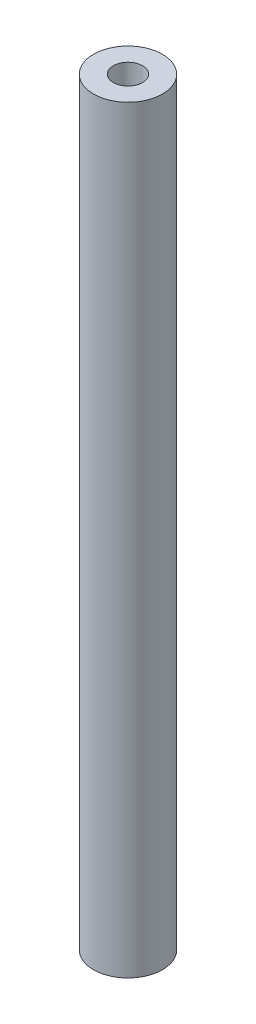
from build123d import *

# Parameters (mm, degrees)
SKETCH2_R           = 4.7625
SKETCH2_R_2         = 2.0193
BOSS_EXTRUDE1_DEPTH = 104.775


with BuildPart() as part:
    # Sketch2 → Boss-Extrude1 (new body)
    with BuildSketch(Plane(origin=(0, 0, 0), x_dir=(1, 0, 0), z_dir=(0, 1, 0))):
        with Locations(Location((0, 0, 0), (0, 0, 270))):
            Circle(SKETCH2_R)
        with Locations(Location((0, 0, 0), (0, 0, 270))):
            Circle(SKETCH2_R_2, mode=Mode.SUBTRACT)
    extrude(amount=BOSS_EXTRUDE1_DEPTH)


solid = part.part
